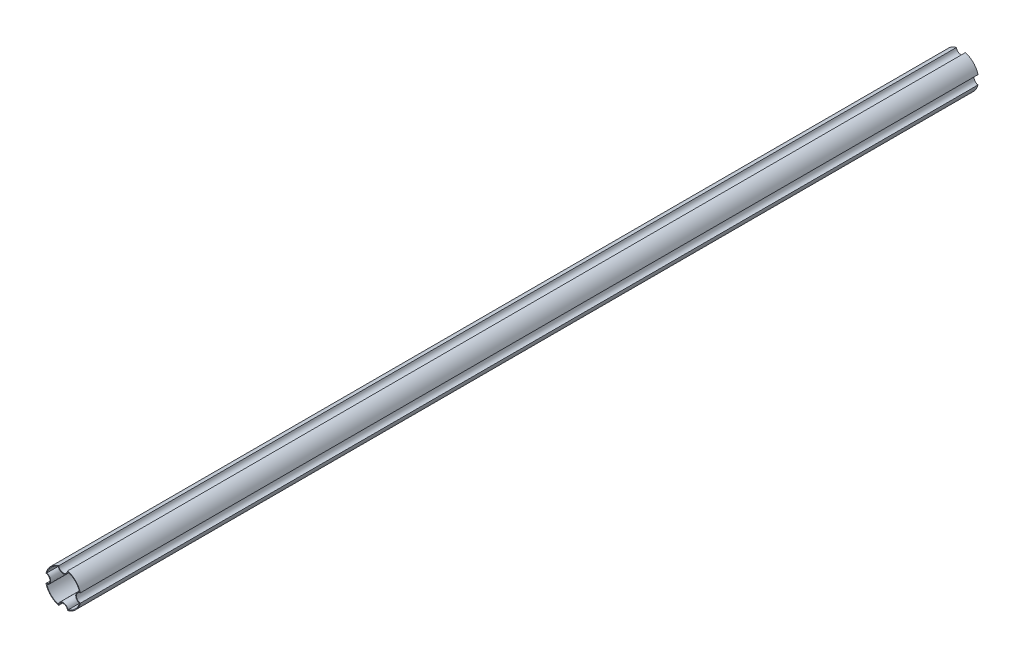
ISO-10303-21;
HEADER;
FILE_DESCRIPTION(('STEP AP214'),'2;1');
FILE_NAME('part.step','',(''),(''),'','','');
FILE_SCHEMA(('AUTOMOTIVE_DESIGN { 1 0 10303 214 1 1 1 1 }'));
ENDSEC;
DATA;
#1=APPLICATION_CONTEXT('core data for automotive mechanical design processes');
#2=APPLICATION_PROTOCOL_DEFINITION('international standard','automotive_design',2000,#1);
#3=PRODUCT_CONTEXT('',#1,'mechanical');
#4=PRODUCT('Part','Part','',(#3));
#5=PRODUCT_RELATED_PRODUCT_CATEGORY('part','',(#4));
#6=PRODUCT_DEFINITION_FORMATION('','',#4);
#7=PRODUCT_DEFINITION_CONTEXT('part definition',#1,'design');
#8=PRODUCT_DEFINITION('design','',#6,#7);
#9=PRODUCT_DEFINITION_SHAPE('','',#8);
#10=(LENGTH_UNIT() NAMED_UNIT(*) SI_UNIT(.MILLI.,.METRE.));
#11=(NAMED_UNIT(*) PLANE_ANGLE_UNIT() SI_UNIT($,.RADIAN.));
#12=(NAMED_UNIT(*) SI_UNIT($,.STERADIAN.) SOLID_ANGLE_UNIT());
#13=UNCERTAINTY_MEASURE_WITH_UNIT(LENGTH_MEASURE(1.E-05),#10,'distance_accuracy_value','');
#14=(GEOMETRIC_REPRESENTATION_CONTEXT(3) GLOBAL_UNCERTAINTY_ASSIGNED_CONTEXT((#13)) GLOBAL_UNIT_ASSIGNED_CONTEXT((#10,
#11,#12)) REPRESENTATION_CONTEXT('',''));
#15=CARTESIAN_POINT('',(0.,0.,0.));
#16=DIRECTION('',(0.,0.,1.));
#17=DIRECTION('',(1.,0.,0.));
#18=AXIS2_PLACEMENT_3D('',#15,#16,#17);
#19=CARTESIAN_POINT('',(0.,0.,-2000.));
#20=DIRECTION('',(0.,0.,1.));
#21=DIRECTION('',(1.,0.,0.));
#22=AXIS2_PLACEMENT_3D('',#19,#20,#21);
#23=CYLINDRICAL_SURFACE('',#22,39.5);
#24=CARTESIAN_POINT('',(0.,0.,0.));
#25=DIRECTION('',(0.,0.,1.));
#26=DIRECTION('',(1.,0.,0.));
#27=AXIS2_PLACEMENT_3D('',#24,#25,#26);
#28=CIRCLE('',#27,39.5);
#29=CARTESIAN_POINT('',(-38.2341772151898,-9.91956111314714,0.));
#30=VERTEX_POINT('',#29);
#31=CARTESIAN_POINT('',(-9.91956111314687,-38.2341772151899,0.));
#32=VERTEX_POINT('',#31);
#33=EDGE_CURVE('E260',#30,#32,#28,.T.);
#34=ORIENTED_EDGE('',*,*,#33,.F.);
#35=DIRECTION('',(0.,0.,1.));
#36=VECTOR('',#35,1.);
#37=CARTESIAN_POINT('',(-38.2341772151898,-9.91956111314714,-2000.));
#38=LINE('',#37,#36);
#39=CARTESIAN_POINT('',(-38.2341772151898,-9.91956111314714,-2000.));
#40=VERTEX_POINT('',#39);
#41=EDGE_CURVE('E14',#40,#30,#38,.T.);
#42=ORIENTED_EDGE('',*,*,#41,.F.);
#43=CARTESIAN_POINT('',(0.,0.,-2000.));
#44=DIRECTION('',(0.,0.,1.));
#45=DIRECTION('',(1.,0.,0.));
#46=AXIS2_PLACEMENT_3D('',#43,#44,#45);
#47=CIRCLE('',#46,39.5);
#48=CARTESIAN_POINT('',(-9.91956111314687,-38.2341772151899,-2000.));
#49=VERTEX_POINT('',#48);
#50=EDGE_CURVE('E272',#40,#49,#47,.T.);
#51=ORIENTED_EDGE('',*,*,#50,.T.);
#52=DIRECTION('',(0.,0.,1.));
#53=VECTOR('',#52,1.);
#54=CARTESIAN_POINT('',(-9.91956111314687,-38.2341772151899,-2000.));
#55=LINE('',#54,#53);
#56=EDGE_CURVE('E93',#49,#32,#55,.T.);
#57=ORIENTED_EDGE('',*,*,#56,.T.);
#58=EDGE_LOOP('',(#34,#42,#51,#57));
#59=FACE_BOUND('',#58,.T.);
#60=ADVANCED_FACE('F90',(#59),#23,.T.);
#61=CARTESIAN_POINT('',(-39.5,-2.75827025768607E-13,-2000.));
#62=DIRECTION('',(0.,0.,1.));
#63=DIRECTION('',(1.,0.,0.));
#64=AXIS2_PLACEMENT_3D('',#61,#62,#63);
#65=CYLINDRICAL_SURFACE('',#64,10.);
#66=CARTESIAN_POINT('',(-39.5,-2.75827025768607E-13,0.));
#67=DIRECTION('',(0.,0.,-1.));
#68=DIRECTION('',(1.,0.,0.));
#69=AXIS2_PLACEMENT_3D('',#66,#67,#68);
#70=CIRCLE('',#69,10.);
#71=CARTESIAN_POINT('',(-38.2341772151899,9.9195611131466,0.));
#72=VERTEX_POINT('',#71);
#73=EDGE_CURVE('E276',#72,#30,#70,.T.);
#74=ORIENTED_EDGE('',*,*,#73,.F.);
#75=DIRECTION('',(0.,0.,1.));
#76=VECTOR('',#75,1.);
#77=CARTESIAN_POINT('',(-38.2341772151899,9.9195611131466,-2000.));
#78=LINE('',#77,#76);
#79=CARTESIAN_POINT('',(-38.2341772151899,9.9195611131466,-2000.));
#80=VERTEX_POINT('',#79);
#81=EDGE_CURVE('E98',#80,#72,#78,.T.);
#82=ORIENTED_EDGE('',*,*,#81,.F.);
#83=CARTESIAN_POINT('',(-39.5,-2.75827025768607E-13,-2000.));
#84=DIRECTION('',(0.,0.,-1.));
#85=DIRECTION('',(1.,0.,0.));
#86=AXIS2_PLACEMENT_3D('',#83,#84,#85);
#87=CIRCLE('',#86,10.);
#88=EDGE_CURVE('E294',#80,#40,#87,.T.);
#89=ORIENTED_EDGE('',*,*,#88,.T.);
#90=ORIENTED_EDGE('',*,*,#41,.T.);
#91=EDGE_LOOP('',(#74,#82,#89,#90));
#92=FACE_BOUND('',#91,.T.);
#93=ADVANCED_FACE('F341',(#92),#65,.F.);
#94=CARTESIAN_POINT('',(0.,0.,-2000.));
#95=DIRECTION('',(0.,0.,1.));
#96=DIRECTION('',(1.,0.,0.));
#97=AXIS2_PLACEMENT_3D('',#94,#95,#96);
#98=CYLINDRICAL_SURFACE('',#97,39.5);
#99=CARTESIAN_POINT('',(0.,0.,0.));
#100=DIRECTION('',(0.,0.,1.));
#101=DIRECTION('',(1.,0.,0.));
#102=AXIS2_PLACEMENT_3D('',#99,#100,#101);
#103=CIRCLE('',#102,39.5);
#104=CARTESIAN_POINT('',(-9.91956111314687,38.2341772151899,0.));
#105=VERTEX_POINT('',#104);
#106=EDGE_CURVE('E314',#105,#72,#103,.T.);
#107=ORIENTED_EDGE('',*,*,#106,.F.);
#108=DIRECTION('',(0.,0.,1.));
#109=VECTOR('',#108,1.);
#110=CARTESIAN_POINT('',(-9.91956111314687,38.2341772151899,-2000.));
#111=LINE('',#110,#109);
#112=CARTESIAN_POINT('',(-9.91956111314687,38.2341772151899,-2000.));
#113=VERTEX_POINT('',#112);
#114=EDGE_CURVE('E320',#113,#105,#111,.T.);
#115=ORIENTED_EDGE('',*,*,#114,.F.);
#116=CARTESIAN_POINT('',(0.,0.,-2000.));
#117=DIRECTION('',(0.,0.,1.));
#118=DIRECTION('',(1.,0.,0.));
#119=AXIS2_PLACEMENT_3D('',#116,#117,#118);
#120=CIRCLE('',#119,39.5);
#121=EDGE_CURVE('E291',#113,#80,#120,.T.);
#122=ORIENTED_EDGE('',*,*,#121,.T.);
#123=ORIENTED_EDGE('',*,*,#81,.T.);
#124=EDGE_LOOP('',(#107,#115,#122,#123));
#125=FACE_BOUND('',#124,.T.);
#126=ADVANCED_FACE('F360',(#125),#98,.T.);
#127=CARTESIAN_POINT('',(0.,39.5,-2000.));
#128=DIRECTION('',(0.,0.,1.));
#129=DIRECTION('',(1.,0.,0.));
#130=AXIS2_PLACEMENT_3D('',#127,#128,#129);
#131=CYLINDRICAL_SURFACE('',#130,10.);
#132=CARTESIAN_POINT('',(0.,39.5,0.));
#133=DIRECTION('',(0.,0.,-1.));
#134=DIRECTION('',(1.,0.,0.));
#135=AXIS2_PLACEMENT_3D('',#132,#133,#134);
#136=CIRCLE('',#135,10.);
#137=CARTESIAN_POINT('',(9.91956111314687,38.2341772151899,0.));
#138=VERTEX_POINT('',#137);
#139=EDGE_CURVE('E311',#138,#105,#136,.T.);
#140=ORIENTED_EDGE('',*,*,#139,.F.);
#141=DIRECTION('',(0.,0.,1.));
#142=VECTOR('',#141,1.);
#143=CARTESIAN_POINT('',(9.91956111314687,38.2341772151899,-2000.));
#144=LINE('',#143,#142);
#145=CARTESIAN_POINT('',(9.91956111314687,38.2341772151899,-2000.));
#146=VERTEX_POINT('',#145);
#147=EDGE_CURVE('E322',#146,#138,#144,.T.);
#148=ORIENTED_EDGE('',*,*,#147,.F.);
#149=CARTESIAN_POINT('',(0.,39.5,-2000.));
#150=DIRECTION('',(0.,0.,-1.));
#151=DIRECTION('',(1.,0.,0.));
#152=AXIS2_PLACEMENT_3D('',#149,#150,#151);
#153=CIRCLE('',#152,10.);
#154=EDGE_CURVE('E288',#146,#113,#153,.T.);
#155=ORIENTED_EDGE('',*,*,#154,.T.);
#156=ORIENTED_EDGE('',*,*,#114,.T.);
#157=EDGE_LOOP('',(#140,#148,#155,#156));
#158=FACE_BOUND('',#157,.T.);
#159=ADVANCED_FACE('F358',(#158),#131,.F.);
#160=CARTESIAN_POINT('',(0.,0.,-2000.));
#161=DIRECTION('',(0.,0.,1.));
#162=DIRECTION('',(1.,0.,0.));
#163=AXIS2_PLACEMENT_3D('',#160,#161,#162);
#164=CYLINDRICAL_SURFACE('',#163,39.5);
#165=CARTESIAN_POINT('',(0.,0.,0.));
#166=DIRECTION('',(0.,0.,1.));
#167=DIRECTION('',(1.,0.,0.));
#168=AXIS2_PLACEMENT_3D('',#165,#166,#167);
#169=CIRCLE('',#168,39.5);
#170=CARTESIAN_POINT('',(38.2341772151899,9.91956111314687,0.));
#171=VERTEX_POINT('',#170);
#172=EDGE_CURVE('E308',#171,#138,#169,.T.);
#173=ORIENTED_EDGE('',*,*,#172,.F.);
#174=DIRECTION('',(0.,0.,1.));
#175=VECTOR('',#174,1.);
#176=CARTESIAN_POINT('',(38.2341772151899,9.91956111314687,-2000.));
#177=LINE('',#176,#175);
#178=CARTESIAN_POINT('',(38.2341772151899,9.91956111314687,-2000.));
#179=VERTEX_POINT('',#178);
#180=EDGE_CURVE('E324',#179,#171,#177,.T.);
#181=ORIENTED_EDGE('',*,*,#180,.F.);
#182=CARTESIAN_POINT('',(0.,0.,-2000.));
#183=DIRECTION('',(0.,0.,1.));
#184=DIRECTION('',(1.,0.,0.));
#185=AXIS2_PLACEMENT_3D('',#182,#183,#184);
#186=CIRCLE('',#185,39.5);
#187=EDGE_CURVE('E285',#179,#146,#186,.T.);
#188=ORIENTED_EDGE('',*,*,#187,.T.);
#189=ORIENTED_EDGE('',*,*,#147,.T.);
#190=EDGE_LOOP('',(#173,#181,#188,#189));
#191=FACE_BOUND('',#190,.T.);
#192=ADVANCED_FACE('F354',(#191),#164,.T.);
#193=CARTESIAN_POINT('',(39.5,0.,-2000.));
#194=DIRECTION('',(0.,0.,1.));
#195=DIRECTION('',(1.,0.,0.));
#196=AXIS2_PLACEMENT_3D('',#193,#194,#195);
#197=CYLINDRICAL_SURFACE('',#196,10.);
#198=CARTESIAN_POINT('',(39.5,0.,0.));
#199=DIRECTION('',(0.,0.,-1.));
#200=DIRECTION('',(1.,0.,0.));
#201=AXIS2_PLACEMENT_3D('',#198,#199,#200);
#202=CIRCLE('',#201,10.);
#203=CARTESIAN_POINT('',(38.2341772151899,-9.91956111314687,0.));
#204=VERTEX_POINT('',#203);
#205=EDGE_CURVE('E305',#204,#171,#202,.T.);
#206=ORIENTED_EDGE('',*,*,#205,.F.);
#207=DIRECTION('',(0.,0.,1.));
#208=VECTOR('',#207,1.);
#209=CARTESIAN_POINT('',(38.2341772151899,-9.91956111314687,-2000.));
#210=LINE('',#209,#208);
#211=CARTESIAN_POINT('',(38.2341772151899,-9.91956111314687,-2000.));
#212=VERTEX_POINT('',#211);
#213=EDGE_CURVE('E326',#212,#204,#210,.T.);
#214=ORIENTED_EDGE('',*,*,#213,.F.);
#215=CARTESIAN_POINT('',(39.5,0.,-2000.));
#216=DIRECTION('',(0.,0.,-1.));
#217=DIRECTION('',(1.,0.,0.));
#218=AXIS2_PLACEMENT_3D('',#215,#216,#217);
#219=CIRCLE('',#218,10.);
#220=EDGE_CURVE('E282',#212,#179,#219,.T.);
#221=ORIENTED_EDGE('',*,*,#220,.T.);
#222=ORIENTED_EDGE('',*,*,#180,.T.);
#223=EDGE_LOOP('',(#206,#214,#221,#222));
#224=FACE_BOUND('',#223,.T.);
#225=ADVANCED_FACE('F352',(#224),#197,.F.);
#226=CARTESIAN_POINT('',(0.,0.,-2000.));
#227=DIRECTION('',(0.,0.,1.));
#228=DIRECTION('',(1.,0.,0.));
#229=AXIS2_PLACEMENT_3D('',#226,#227,#228);
#230=CYLINDRICAL_SURFACE('',#229,39.5);
#231=CARTESIAN_POINT('',(0.,0.,0.));
#232=DIRECTION('',(0.,0.,1.));
#233=DIRECTION('',(1.,0.,0.));
#234=AXIS2_PLACEMENT_3D('',#231,#232,#233);
#235=CIRCLE('',#234,39.5);
#236=CARTESIAN_POINT('',(9.91956111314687,-38.2341772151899,0.));
#237=VERTEX_POINT('',#236);
#238=EDGE_CURVE('E302',#237,#204,#235,.T.);
#239=ORIENTED_EDGE('',*,*,#238,.F.);
#240=DIRECTION('',(0.,0.,1.));
#241=VECTOR('',#240,1.);
#242=CARTESIAN_POINT('',(9.91956111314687,-38.2341772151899,-2000.));
#243=LINE('',#242,#241);
#244=CARTESIAN_POINT('',(9.91956111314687,-38.2341772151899,-2000.));
#245=VERTEX_POINT('',#244);
#246=EDGE_CURVE('E327',#245,#237,#243,.T.);
#247=ORIENTED_EDGE('',*,*,#246,.F.);
#248=CARTESIAN_POINT('',(0.,0.,-2000.));
#249=DIRECTION('',(0.,0.,1.));
#250=DIRECTION('',(1.,0.,0.));
#251=AXIS2_PLACEMENT_3D('',#248,#249,#250);
#252=CIRCLE('',#251,39.5);
#253=EDGE_CURVE('E279',#245,#212,#252,.T.);
#254=ORIENTED_EDGE('',*,*,#253,.T.);
#255=ORIENTED_EDGE('',*,*,#213,.T.);
#256=EDGE_LOOP('',(#239,#247,#254,#255));
#257=FACE_BOUND('',#256,.T.);
#258=ADVANCED_FACE('F348',(#257),#230,.T.);
#259=CARTESIAN_POINT('',(0.,-39.5,-2000.));
#260=DIRECTION('',(0.,0.,1.));
#261=DIRECTION('',(1.,0.,0.));
#262=AXIS2_PLACEMENT_3D('',#259,#260,#261);
#263=CYLINDRICAL_SURFACE('',#262,10.);
#264=CARTESIAN_POINT('',(0.,-39.5,0.));
#265=DIRECTION('',(0.,0.,-1.));
#266=DIRECTION('',(1.,0.,0.));
#267=AXIS2_PLACEMENT_3D('',#264,#265,#266);
#268=CIRCLE('',#267,10.);
#269=EDGE_CURVE('E299',#32,#237,#268,.T.);
#270=ORIENTED_EDGE('',*,*,#269,.F.);
#271=ORIENTED_EDGE('',*,*,#56,.F.);
#272=CARTESIAN_POINT('',(0.,-39.5,-2000.));
#273=DIRECTION('',(0.,0.,-1.));
#274=DIRECTION('',(1.,0.,0.));
#275=AXIS2_PLACEMENT_3D('',#272,#273,#274);
#276=CIRCLE('',#275,10.);
#277=EDGE_CURVE('E275',#49,#245,#276,.T.);
#278=ORIENTED_EDGE('',*,*,#277,.T.);
#279=ORIENTED_EDGE('',*,*,#246,.T.);
#280=EDGE_LOOP('',(#270,#271,#278,#279));
#281=FACE_BOUND('',#280,.T.);
#282=ADVANCED_FACE('F335',(#281),#263,.F.);
#283=CARTESIAN_POINT('',(0.,-19.75,-2000.));
#284=DIRECTION('',(0.,0.,1.));
#285=DIRECTION('',(1.,0.,0.));
#286=AXIS2_PLACEMENT_3D('',#283,#284,#285);
#287=PLANE('',#286);
#288=CARTESIAN_POINT('',(-39.5,-2.75827025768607E-13,-2000.));
#289=DIRECTION('',(0.,0.,1.));
#290=DIRECTION('',(1.,0.,0.));
#291=AXIS2_PLACEMENT_3D('',#288,#289,#290);
#292=CIRCLE('',#291,11.5);
#293=CARTESIAN_POINT('',(-36.3544303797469,11.0614371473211,-2000.));
#294=VERTEX_POINT('',#293);
#295=CARTESIAN_POINT('',(-36.3544303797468,-11.0614371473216,-2000.));
#296=VERTEX_POINT('',#295);
#297=EDGE_CURVE('E211',#294,#296,#292,.F.);
#298=ORIENTED_EDGE('',*,*,#297,.T.);
#299=CARTESIAN_POINT('',(0.,0.,-2000.));
#300=DIRECTION('',(0.,0.,1.));
#301=DIRECTION('',(1.,0.,0.));
#302=AXIS2_PLACEMENT_3D('',#299,#300,#301);
#303=CIRCLE('',#302,38.);
#304=CARTESIAN_POINT('',(-11.0614371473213,-36.3544303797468,-2000.));
#305=VERTEX_POINT('',#304);
#306=EDGE_CURVE('E205',#296,#305,#303,.T.);
#307=ORIENTED_EDGE('',*,*,#306,.T.);
#308=CARTESIAN_POINT('',(0.,-39.5,-2000.));
#309=DIRECTION('',(0.,0.,1.));
#310=DIRECTION('',(1.,0.,0.));
#311=AXIS2_PLACEMENT_3D('',#308,#309,#310);
#312=CIRCLE('',#311,11.5);
#313=CARTESIAN_POINT('',(11.0614371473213,-36.3544303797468,-2000.));
#314=VERTEX_POINT('',#313);
#315=EDGE_CURVE('E214',#305,#314,#312,.F.);
#316=ORIENTED_EDGE('',*,*,#315,.T.);
#317=CARTESIAN_POINT('',(0.,0.,-2000.));
#318=DIRECTION('',(0.,0.,1.));
#319=DIRECTION('',(1.,0.,0.));
#320=AXIS2_PLACEMENT_3D('',#317,#318,#319);
#321=CIRCLE('',#320,38.);
#322=CARTESIAN_POINT('',(36.3544303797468,-11.0614371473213,-2000.));
#323=VERTEX_POINT('',#322);
#324=EDGE_CURVE('E106',#314,#323,#321,.T.);
#325=ORIENTED_EDGE('',*,*,#324,.T.);
#326=CARTESIAN_POINT('',(39.5,0.,-2000.));
#327=DIRECTION('',(0.,0.,1.));
#328=DIRECTION('',(1.,0.,0.));
#329=AXIS2_PLACEMENT_3D('',#326,#327,#328);
#330=CIRCLE('',#329,11.5);
#331=CARTESIAN_POINT('',(36.3544303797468,11.0614371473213,-2000.));
#332=VERTEX_POINT('',#331);
#333=EDGE_CURVE('E229',#323,#332,#330,.F.);
#334=ORIENTED_EDGE('',*,*,#333,.T.);
#335=CARTESIAN_POINT('',(0.,0.,-2000.));
#336=DIRECTION('',(0.,0.,1.));
#337=DIRECTION('',(1.,0.,0.));
#338=AXIS2_PLACEMENT_3D('',#335,#336,#337);
#339=CIRCLE('',#338,38.);
#340=CARTESIAN_POINT('',(11.0614371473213,36.3544303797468,-2000.));
#341=VERTEX_POINT('',#340);
#342=EDGE_CURVE('E232',#332,#341,#339,.T.);
#343=ORIENTED_EDGE('',*,*,#342,.T.);
#344=CARTESIAN_POINT('',(0.,39.5,-2000.));
#345=DIRECTION('',(0.,0.,1.));
#346=DIRECTION('',(1.,0.,0.));
#347=AXIS2_PLACEMENT_3D('',#344,#345,#346);
#348=CIRCLE('',#347,11.5);
#349=CARTESIAN_POINT('',(-11.0614371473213,36.3544303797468,-2000.));
#350=VERTEX_POINT('',#349);
#351=EDGE_CURVE('E235',#341,#350,#348,.F.);
#352=ORIENTED_EDGE('',*,*,#351,.T.);
#353=CARTESIAN_POINT('',(0.,0.,-2000.));
#354=DIRECTION('',(0.,0.,1.));
#355=DIRECTION('',(1.,0.,0.));
#356=AXIS2_PLACEMENT_3D('',#353,#354,#355);
#357=CIRCLE('',#356,38.);
#358=EDGE_CURVE('E238',#350,#294,#357,.T.);
#359=ORIENTED_EDGE('',*,*,#358,.T.);
#360=EDGE_LOOP('',(#298,#307,#316,#325,#334,#343,#352,#359));
#361=FACE_BOUND('',#360,.T.);
#362=ORIENTED_EDGE('',*,*,#50,.F.);
#363=ORIENTED_EDGE('',*,*,#88,.F.);
#364=ORIENTED_EDGE('',*,*,#121,.F.);
#365=ORIENTED_EDGE('',*,*,#154,.F.);
#366=ORIENTED_EDGE('',*,*,#187,.F.);
#367=ORIENTED_EDGE('',*,*,#220,.F.);
#368=ORIENTED_EDGE('',*,*,#253,.F.);
#369=ORIENTED_EDGE('',*,*,#277,.F.);
#370=EDGE_LOOP('',(#362,#363,#364,#365,#366,#367,#368,#369));
#371=FACE_BOUND('',#370,.T.);
#372=ADVANCED_FACE('F218',(#361,#371),#287,.F.);
#373=CARTESIAN_POINT('',(0.,-19.75,0.));
#374=DIRECTION('',(0.,0.,1.));
#375=DIRECTION('',(1.,0.,0.));
#376=AXIS2_PLACEMENT_3D('',#373,#374,#375);
#377=PLANE('',#376);
#378=CARTESIAN_POINT('',(0.,0.,0.));
#379=DIRECTION('',(0.,0.,1.));
#380=DIRECTION('',(1.,0.,0.));
#381=AXIS2_PLACEMENT_3D('',#378,#379,#380);
#382=CIRCLE('',#381,38.);
#383=CARTESIAN_POINT('',(-36.3544303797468,-11.0614371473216,0.));
#384=VERTEX_POINT('',#383);
#385=CARTESIAN_POINT('',(-11.0614371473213,-36.3544303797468,0.));
#386=VERTEX_POINT('',#385);
#387=EDGE_CURVE('E114',#384,#386,#382,.T.);
#388=ORIENTED_EDGE('',*,*,#387,.F.);
#389=CARTESIAN_POINT('',(-39.5,-2.75827025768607E-13,0.));
#390=DIRECTION('',(0.,0.,1.));
#391=DIRECTION('',(1.,0.,0.));
#392=AXIS2_PLACEMENT_3D('',#389,#390,#391);
#393=CIRCLE('',#392,11.5);
#394=CARTESIAN_POINT('',(-36.3544303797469,11.0614371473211,0.));
#395=VERTEX_POINT('',#394);
#396=EDGE_CURVE('E222',#395,#384,#393,.F.);
#397=ORIENTED_EDGE('',*,*,#396,.F.);
#398=CARTESIAN_POINT('',(0.,0.,0.));
#399=DIRECTION('',(0.,0.,1.));
#400=DIRECTION('',(1.,0.,0.));
#401=AXIS2_PLACEMENT_3D('',#398,#399,#400);
#402=CIRCLE('',#401,38.);
#403=CARTESIAN_POINT('',(-11.0614371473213,36.3544303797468,0.));
#404=VERTEX_POINT('',#403);
#405=EDGE_CURVE('E225',#404,#395,#402,.T.);
#406=ORIENTED_EDGE('',*,*,#405,.F.);
#407=CARTESIAN_POINT('',(0.,39.5,0.));
#408=DIRECTION('',(0.,0.,1.));
#409=DIRECTION('',(1.,0.,0.));
#410=AXIS2_PLACEMENT_3D('',#407,#408,#409);
#411=CIRCLE('',#410,11.5);
#412=CARTESIAN_POINT('',(11.0614371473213,36.3544303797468,0.));
#413=VERTEX_POINT('',#412);
#414=EDGE_CURVE('E253',#413,#404,#411,.F.);
#415=ORIENTED_EDGE('',*,*,#414,.F.);
#416=CARTESIAN_POINT('',(0.,0.,0.));
#417=DIRECTION('',(0.,0.,1.));
#418=DIRECTION('',(1.,0.,0.));
#419=AXIS2_PLACEMENT_3D('',#416,#417,#418);
#420=CIRCLE('',#419,38.);
#421=CARTESIAN_POINT('',(36.3544303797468,11.0614371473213,0.));
#422=VERTEX_POINT('',#421);
#423=EDGE_CURVE('E250',#422,#413,#420,.T.);
#424=ORIENTED_EDGE('',*,*,#423,.F.);
#425=CARTESIAN_POINT('',(39.5,0.,0.));
#426=DIRECTION('',(0.,0.,1.));
#427=DIRECTION('',(1.,0.,0.));
#428=AXIS2_PLACEMENT_3D('',#425,#426,#427);
#429=CIRCLE('',#428,11.5);
#430=CARTESIAN_POINT('',(36.3544303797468,-11.0614371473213,0.));
#431=VERTEX_POINT('',#430);
#432=EDGE_CURVE('E247',#431,#422,#429,.F.);
#433=ORIENTED_EDGE('',*,*,#432,.F.);
#434=CARTESIAN_POINT('',(0.,0.,0.));
#435=DIRECTION('',(0.,0.,1.));
#436=DIRECTION('',(1.,0.,0.));
#437=AXIS2_PLACEMENT_3D('',#434,#435,#436);
#438=CIRCLE('',#437,38.);
#439=CARTESIAN_POINT('',(11.0614371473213,-36.3544303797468,0.));
#440=VERTEX_POINT('',#439);
#441=EDGE_CURVE('E244',#440,#431,#438,.T.);
#442=ORIENTED_EDGE('',*,*,#441,.F.);
#443=CARTESIAN_POINT('',(0.,-39.5,0.));
#444=DIRECTION('',(0.,0.,1.));
#445=DIRECTION('',(1.,0.,0.));
#446=AXIS2_PLACEMENT_3D('',#443,#444,#445);
#447=CIRCLE('',#446,11.5);
#448=EDGE_CURVE('E242',#386,#440,#447,.F.);
#449=ORIENTED_EDGE('',*,*,#448,.F.);
#450=EDGE_LOOP('',(#388,#397,#406,#415,#424,#433,#442,#449));
#451=FACE_BOUND('',#450,.T.);
#452=ORIENTED_EDGE('',*,*,#33,.T.);
#453=ORIENTED_EDGE('',*,*,#269,.T.);
#454=ORIENTED_EDGE('',*,*,#238,.T.);
#455=ORIENTED_EDGE('',*,*,#205,.T.);
#456=ORIENTED_EDGE('',*,*,#172,.T.);
#457=ORIENTED_EDGE('',*,*,#139,.T.);
#458=ORIENTED_EDGE('',*,*,#106,.T.);
#459=ORIENTED_EDGE('',*,*,#73,.T.);
#460=EDGE_LOOP('',(#452,#453,#454,#455,#456,#457,#458,#459));
#461=FACE_BOUND('',#460,.T.);
#462=ADVANCED_FACE('F337',(#451,#461),#377,.T.);
#463=CARTESIAN_POINT('',(0.,0.,-2000.));
#464=DIRECTION('',(0.,0.,1.));
#465=DIRECTION('',(1.,0.,0.));
#466=AXIS2_PLACEMENT_3D('',#463,#464,#465);
#467=CYLINDRICAL_SURFACE('',#466,38.);
#468=ORIENTED_EDGE('',*,*,#387,.T.);
#469=DIRECTION('',(0.,0.,1.));
#470=VECTOR('',#469,1.);
#471=CARTESIAN_POINT('',(-11.0614371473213,-36.3544303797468,-2000.));
#472=LINE('',#471,#470);
#473=EDGE_CURVE('E201',#305,#386,#472,.T.);
#474=ORIENTED_EDGE('',*,*,#473,.F.);
#475=ORIENTED_EDGE('',*,*,#306,.F.);
#476=DIRECTION('',(0.,0.,1.));
#477=VECTOR('',#476,1.);
#478=CARTESIAN_POINT('',(-36.3544303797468,-11.0614371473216,-2000.));
#479=LINE('',#478,#477);
#480=EDGE_CURVE('E258',#296,#384,#479,.T.);
#481=ORIENTED_EDGE('',*,*,#480,.T.);
#482=EDGE_LOOP('',(#468,#474,#475,#481));
#483=FACE_BOUND('',#482,.T.);
#484=ADVANCED_FACE('F203',(#483),#467,.F.);
#485=CARTESIAN_POINT('',(-39.5,-2.75827025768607E-13,-2000.));
#486=DIRECTION('',(0.,0.,1.));
#487=DIRECTION('',(1.,0.,0.));
#488=AXIS2_PLACEMENT_3D('',#485,#486,#487);
#489=CYLINDRICAL_SURFACE('',#488,11.5);
#490=ORIENTED_EDGE('',*,*,#396,.T.);
#491=ORIENTED_EDGE('',*,*,#480,.F.);
#492=ORIENTED_EDGE('',*,*,#297,.F.);
#493=DIRECTION('',(0.,0.,1.));
#494=VECTOR('',#493,1.);
#495=CARTESIAN_POINT('',(-36.3544303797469,11.0614371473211,-2000.));
#496=LINE('',#495,#494);
#497=EDGE_CURVE('E261',#294,#395,#496,.T.);
#498=ORIENTED_EDGE('',*,*,#497,.T.);
#499=EDGE_LOOP('',(#490,#491,#492,#498));
#500=FACE_BOUND('',#499,.T.);
#501=ADVANCED_FACE('F443',(#500),#489,.T.);
#502=CARTESIAN_POINT('',(0.,0.,-2000.));
#503=DIRECTION('',(0.,0.,1.));
#504=DIRECTION('',(1.,0.,0.));
#505=AXIS2_PLACEMENT_3D('',#502,#503,#504);
#506=CYLINDRICAL_SURFACE('',#505,38.);
#507=ORIENTED_EDGE('',*,*,#405,.T.);
#508=ORIENTED_EDGE('',*,*,#497,.F.);
#509=ORIENTED_EDGE('',*,*,#358,.F.);
#510=DIRECTION('',(0.,0.,1.));
#511=VECTOR('',#510,1.);
#512=CARTESIAN_POINT('',(-11.0614371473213,36.3544303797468,-2000.));
#513=LINE('',#512,#511);
#514=EDGE_CURVE('E263',#350,#404,#513,.T.);
#515=ORIENTED_EDGE('',*,*,#514,.T.);
#516=EDGE_LOOP('',(#507,#508,#509,#515));
#517=FACE_BOUND('',#516,.T.);
#518=ADVANCED_FACE('F452',(#517),#506,.F.);
#519=CARTESIAN_POINT('',(0.,39.5,-2000.));
#520=DIRECTION('',(0.,0.,1.));
#521=DIRECTION('',(1.,0.,0.));
#522=AXIS2_PLACEMENT_3D('',#519,#520,#521);
#523=CYLINDRICAL_SURFACE('',#522,11.5);
#524=ORIENTED_EDGE('',*,*,#414,.T.);
#525=ORIENTED_EDGE('',*,*,#514,.F.);
#526=ORIENTED_EDGE('',*,*,#351,.F.);
#527=DIRECTION('',(0.,0.,1.));
#528=VECTOR('',#527,1.);
#529=CARTESIAN_POINT('',(11.0614371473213,36.3544303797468,-2000.));
#530=LINE('',#529,#528);
#531=EDGE_CURVE('E265',#341,#413,#530,.T.);
#532=ORIENTED_EDGE('',*,*,#531,.T.);
#533=EDGE_LOOP('',(#524,#525,#526,#532));
#534=FACE_BOUND('',#533,.T.);
#535=ADVANCED_FACE('F462',(#534),#523,.T.);
#536=CARTESIAN_POINT('',(0.,0.,-2000.));
#537=DIRECTION('',(0.,0.,1.));
#538=DIRECTION('',(1.,0.,0.));
#539=AXIS2_PLACEMENT_3D('',#536,#537,#538);
#540=CYLINDRICAL_SURFACE('',#539,38.);
#541=ORIENTED_EDGE('',*,*,#423,.T.);
#542=ORIENTED_EDGE('',*,*,#531,.F.);
#543=ORIENTED_EDGE('',*,*,#342,.F.);
#544=DIRECTION('',(0.,0.,1.));
#545=VECTOR('',#544,1.);
#546=CARTESIAN_POINT('',(36.3544303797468,11.0614371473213,-2000.));
#547=LINE('',#546,#545);
#548=EDGE_CURVE('E267',#332,#422,#547,.T.);
#549=ORIENTED_EDGE('',*,*,#548,.T.);
#550=EDGE_LOOP('',(#541,#542,#543,#549));
#551=FACE_BOUND('',#550,.T.);
#552=ADVANCED_FACE('F472',(#551),#540,.F.);
#553=CARTESIAN_POINT('',(39.5,0.,-2000.));
#554=DIRECTION('',(0.,0.,1.));
#555=DIRECTION('',(1.,0.,0.));
#556=AXIS2_PLACEMENT_3D('',#553,#554,#555);
#557=CYLINDRICAL_SURFACE('',#556,11.5);
#558=ORIENTED_EDGE('',*,*,#432,.T.);
#559=ORIENTED_EDGE('',*,*,#548,.F.);
#560=ORIENTED_EDGE('',*,*,#333,.F.);
#561=DIRECTION('',(0.,0.,1.));
#562=VECTOR('',#561,1.);
#563=CARTESIAN_POINT('',(36.3544303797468,-11.0614371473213,-2000.));
#564=LINE('',#563,#562);
#565=EDGE_CURVE('E269',#323,#431,#564,.T.);
#566=ORIENTED_EDGE('',*,*,#565,.T.);
#567=EDGE_LOOP('',(#558,#559,#560,#566));
#568=FACE_BOUND('',#567,.T.);
#569=ADVANCED_FACE('F482',(#568),#557,.T.);
#570=CARTESIAN_POINT('',(0.,0.,-2000.));
#571=DIRECTION('',(0.,0.,1.));
#572=DIRECTION('',(1.,0.,0.));
#573=AXIS2_PLACEMENT_3D('',#570,#571,#572);
#574=CYLINDRICAL_SURFACE('',#573,38.);
#575=ORIENTED_EDGE('',*,*,#441,.T.);
#576=ORIENTED_EDGE('',*,*,#565,.F.);
#577=ORIENTED_EDGE('',*,*,#324,.F.);
#578=DIRECTION('',(0.,0.,1.));
#579=VECTOR('',#578,1.);
#580=CARTESIAN_POINT('',(11.0614371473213,-36.3544303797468,-2000.));
#581=LINE('',#580,#579);
#582=EDGE_CURVE('E210',#314,#440,#581,.T.);
#583=ORIENTED_EDGE('',*,*,#582,.T.);
#584=EDGE_LOOP('',(#575,#576,#577,#583));
#585=FACE_BOUND('',#584,.T.);
#586=ADVANCED_FACE('F492',(#585),#574,.F.);
#587=CARTESIAN_POINT('',(0.,-39.5,-2000.));
#588=DIRECTION('',(0.,0.,1.));
#589=DIRECTION('',(1.,0.,0.));
#590=AXIS2_PLACEMENT_3D('',#587,#588,#589);
#591=CYLINDRICAL_SURFACE('',#590,11.5);
#592=ORIENTED_EDGE('',*,*,#448,.T.);
#593=ORIENTED_EDGE('',*,*,#582,.F.);
#594=ORIENTED_EDGE('',*,*,#315,.F.);
#595=ORIENTED_EDGE('',*,*,#473,.T.);
#596=EDGE_LOOP('',(#592,#593,#594,#595));
#597=FACE_BOUND('',#596,.T.);
#598=ADVANCED_FACE('F215',(#597),#591,.T.);
#599=CLOSED_SHELL('',(#60,#93,#126,#159,#192,#225,#258,#282,#372,#462,#484,#501,#518,#535,#552,
#569,#586,#598));
#600=MANIFOLD_SOLID_BREP('B2',#599);
#601=ADVANCED_BREP_SHAPE_REPRESENTATION('',(#18,#600),#14);
#602=SHAPE_DEFINITION_REPRESENTATION(#9,#601);
ENDSEC;
END-ISO-10303-21;
